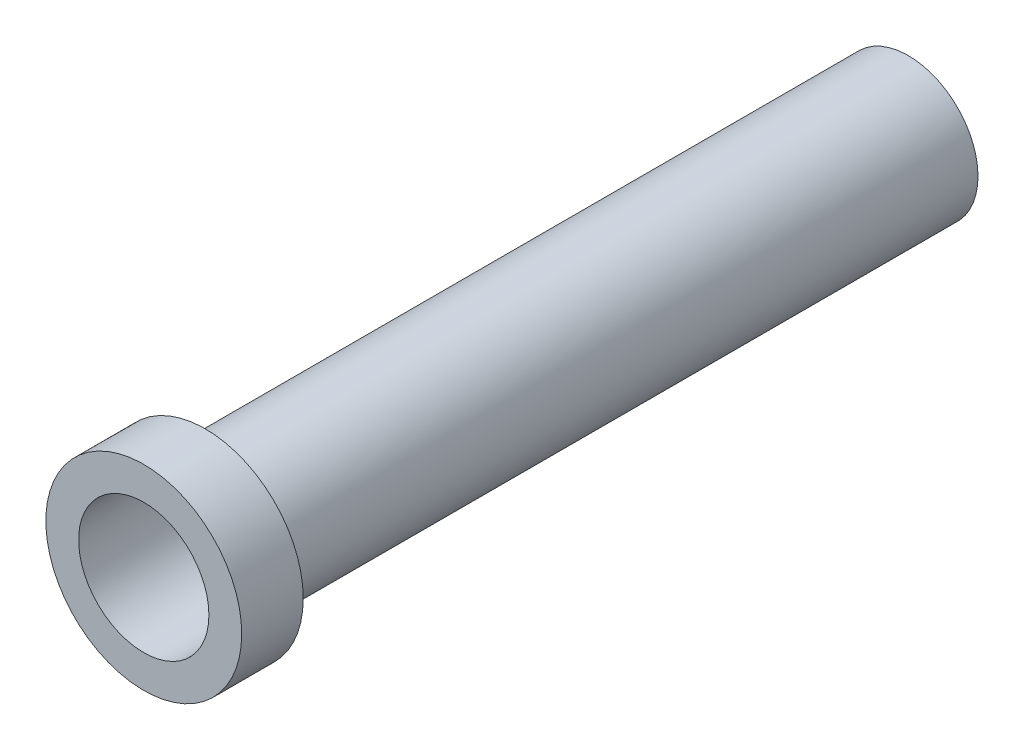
from build123d import *

# Parameters (mm, degrees)
SKETCH1_R           = 26.9875
SKETCH1_R_2         = 25.2095
BOSS_EXTRUDE2_DEPTH = 295.91
BOSS_EXTRUDE3_START = -23.8125
SKETCH2_R           = 37.9095
SKETCH2_R_2         = 25.2095
BOSS_EXTRUDE3_DEPTH = 23.8125


with BuildPart() as part:
    # Sketch1 → Boss-Extrude2 (new body)
    with BuildSketch(Plane.XY):
        Circle(SKETCH1_R)
        Circle(SKETCH1_R_2, mode=Mode.SUBTRACT)
    extrude(amount=BOSS_EXTRUDE2_DEPTH)

    # Sketch2 → Boss-Extrude3 (add)
    with BuildSketch(Plane.XY.offset(295.91).offset(BOSS_EXTRUDE3_START)):
        Circle(SKETCH2_R)
        Circle(SKETCH2_R_2, mode=Mode.SUBTRACT)
    extrude(amount=BOSS_EXTRUDE3_DEPTH)


solid = part.part
